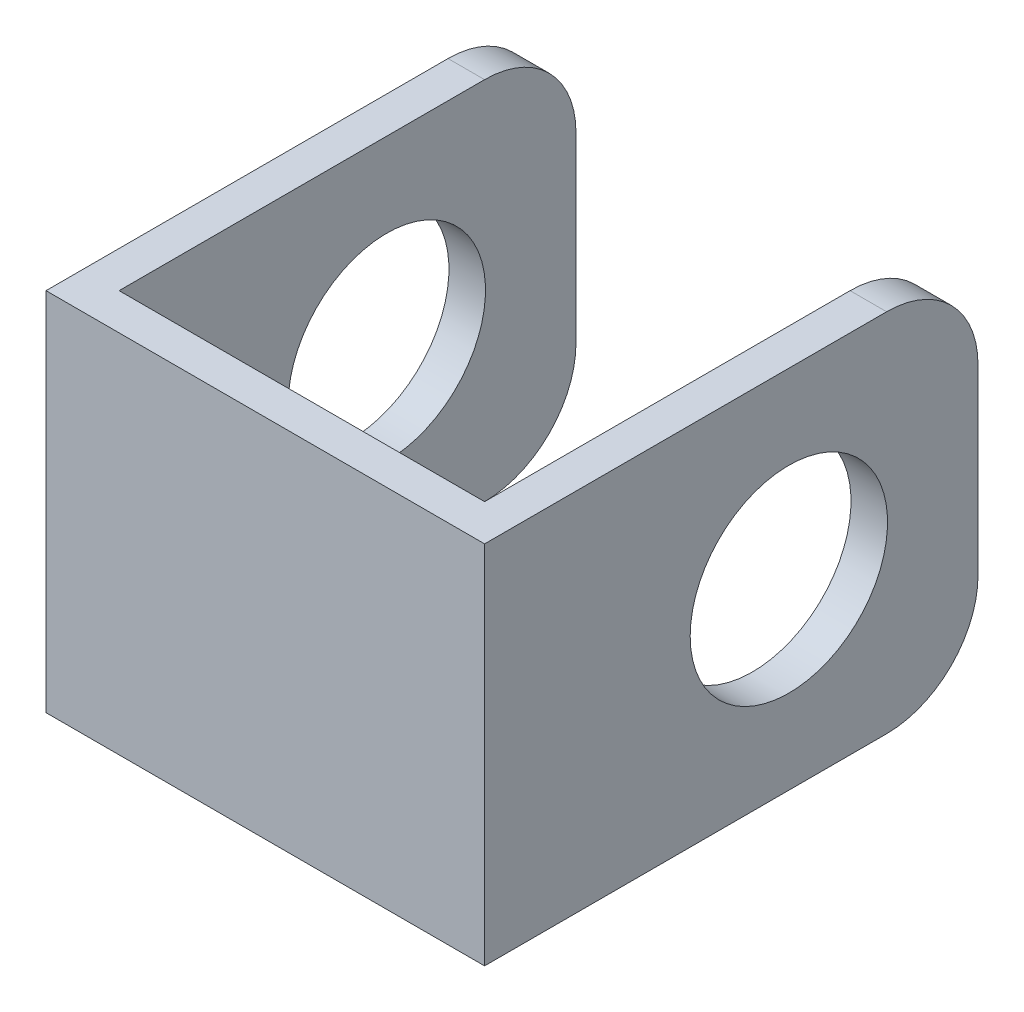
ISO-10303-21;
HEADER;
FILE_DESCRIPTION(('STEP AP214'),'2;1');
FILE_NAME('part.step','',(''),(''),'','','');
FILE_SCHEMA(('AUTOMOTIVE_DESIGN { 1 0 10303 214 1 1 1 1 }'));
ENDSEC;
DATA;
#1=APPLICATION_CONTEXT('core data for automotive mechanical design processes');
#2=APPLICATION_PROTOCOL_DEFINITION('international standard','automotive_design',2000,#1);
#3=PRODUCT_CONTEXT('',#1,'mechanical');
#4=PRODUCT('Part','Part','',(#3));
#5=PRODUCT_RELATED_PRODUCT_CATEGORY('part','',(#4));
#6=PRODUCT_DEFINITION_FORMATION('','',#4);
#7=PRODUCT_DEFINITION_CONTEXT('part definition',#1,'design');
#8=PRODUCT_DEFINITION('design','',#6,#7);
#9=PRODUCT_DEFINITION_SHAPE('','',#8);
#10=(LENGTH_UNIT() NAMED_UNIT(*) SI_UNIT(.MILLI.,.METRE.));
#11=(NAMED_UNIT(*) PLANE_ANGLE_UNIT() SI_UNIT($,.RADIAN.));
#12=(NAMED_UNIT(*) SI_UNIT($,.STERADIAN.) SOLID_ANGLE_UNIT());
#13=UNCERTAINTY_MEASURE_WITH_UNIT(LENGTH_MEASURE(1.E-05),#10,'distance_accuracy_value','');
#14=(GEOMETRIC_REPRESENTATION_CONTEXT(3) GLOBAL_UNCERTAINTY_ASSIGNED_CONTEXT((#13)) GLOBAL_UNIT_ASSIGNED_CONTEXT((#10,
#11,#12)) REPRESENTATION_CONTEXT('',''));
#15=CARTESIAN_POINT('',(0.,0.,0.));
#16=DIRECTION('',(0.,0.,1.));
#17=DIRECTION('',(1.,0.,0.));
#18=AXIS2_PLACEMENT_3D('',#15,#16,#17);
#19=CARTESIAN_POINT('',(12.,0.,-10.35));
#20=DIRECTION('',(0.,0.,-1.));
#21=DIRECTION('',(-1.,0.,0.));
#22=AXIS2_PLACEMENT_3D('',#19,#20,#21);
#23=PLANE('',#22);
#24=DIRECTION('',(0.,1.,0.));
#25=VECTOR('',#24,1.);
#26=CARTESIAN_POINT('',(9.99999999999,0.,-10.35));
#27=LINE('',#26,#25);
#28=CARTESIAN_POINT('',(9.99999999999,5.,-10.35));
#29=VERTEX_POINT('',#28);
#30=CARTESIAN_POINT('',(9.99999999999,-5.,-10.35));
#31=VERTEX_POINT('',#30);
#32=EDGE_CURVE('E102',#29,#31,#27,.F.);
#33=ORIENTED_EDGE('',*,*,#32,.F.);
#34=DIRECTION('',(-1.,0.,0.));
#35=VECTOR('',#34,1.);
#36=CARTESIAN_POINT('',(0.,5.,-10.35));
#37=LINE('',#36,#35);
#38=CARTESIAN_POINT('',(12.,5.,-10.35));
#39=VERTEX_POINT('',#38);
#40=EDGE_CURVE('E113',#39,#29,#37,.T.);
#41=ORIENTED_EDGE('',*,*,#40,.F.);
#42=DIRECTION('',(0.,1.,0.));
#43=VECTOR('',#42,1.);
#44=CARTESIAN_POINT('',(12.,0.,-10.35));
#45=LINE('',#44,#43);
#46=CARTESIAN_POINT('',(12.,-5.,-10.35));
#47=VERTEX_POINT('',#46);
#48=EDGE_CURVE('E117',#39,#47,#45,.F.);
#49=ORIENTED_EDGE('',*,*,#48,.T.);
#50=DIRECTION('',(-1.,0.,0.));
#51=VECTOR('',#50,1.);
#52=CARTESIAN_POINT('',(0.,-5.,-10.35));
#53=LINE('',#52,#51);
#54=EDGE_CURVE('E116',#31,#47,#53,.F.);
#55=ORIENTED_EDGE('',*,*,#54,.F.);
#56=EDGE_LOOP('',(#33,#41,#49,#55));
#57=FACE_BOUND('',#56,.T.);
#58=ADVANCED_FACE('F16',(#57),#23,.T.);
#59=CARTESIAN_POINT('',(0.660000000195,0.,0.));
#60=DIRECTION('',(-1.,0.,0.));
#61=DIRECTION('',(0.,0.,1.));
#62=AXIS2_PLACEMENT_3D('',#59,#60,#61);
#63=CYLINDRICAL_SURFACE('',#62,5.4);
#64=CARTESIAN_POINT('',(12.,0.,0.));
#65=DIRECTION('',(-1.,0.,0.));
#66=DIRECTION('',(0.,0.,1.));
#67=AXIS2_PLACEMENT_3D('',#64,#65,#66);
#68=CIRCLE('',#67,5.4);
#69=CARTESIAN_POINT('',(12.,0.,5.4));
#70=VERTEX_POINT('',#69);
#71=EDGE_CURVE('E147',#70,#70,#68,.F.);
#72=ORIENTED_EDGE('',*,*,#71,.T.);
#73=EDGE_LOOP('',(#72));
#74=FACE_BOUND('',#73,.T.);
#75=CARTESIAN_POINT('',(9.99999999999,0.,0.));
#76=DIRECTION('',(-1.,0.,0.));
#77=DIRECTION('',(0.,0.,1.));
#78=AXIS2_PLACEMENT_3D('',#75,#76,#77);
#79=CIRCLE('',#78,5.4);
#80=CARTESIAN_POINT('',(9.99999999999,0.,5.4));
#81=VERTEX_POINT('',#80);
#82=EDGE_CURVE('E126',#81,#81,#79,.F.);
#83=ORIENTED_EDGE('',*,*,#82,.F.);
#84=EDGE_LOOP('',(#83));
#85=FACE_BOUND('',#84,.T.);
#86=ADVANCED_FACE('F315',(#74,#85),#63,.F.);
#87=CARTESIAN_POINT('',(0.,-5.,-5.35));
#88=DIRECTION('',(-1.,0.,0.));
#89=DIRECTION('',(0.,0.,1.));
#90=AXIS2_PLACEMENT_3D('',#87,#88,#89);
#91=CYLINDRICAL_SURFACE('',#90,5.);
#92=CARTESIAN_POINT('',(12.,-5.,-5.35));
#93=DIRECTION('',(-1.,0.,0.));
#94=DIRECTION('',(0.,0.,1.));
#95=AXIS2_PLACEMENT_3D('',#92,#93,#94);
#96=CIRCLE('',#95,5.);
#97=CARTESIAN_POINT('',(12.,-10.,-5.35));
#98=VERTEX_POINT('',#97);
#99=EDGE_CURVE('E142',#47,#98,#96,.T.);
#100=ORIENTED_EDGE('',*,*,#99,.T.);
#101=DIRECTION('',(1.,0.,0.));
#102=VECTOR('',#101,1.);
#103=CARTESIAN_POINT('',(0.,-10.,-5.35));
#104=LINE('',#103,#102);
#105=CARTESIAN_POINT('',(9.99999999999,-10.,-5.35));
#106=VERTEX_POINT('',#105);
#107=EDGE_CURVE('E125',#98,#106,#104,.F.);
#108=ORIENTED_EDGE('',*,*,#107,.T.);
#109=CARTESIAN_POINT('',(9.99999999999,-5.,-5.35));
#110=DIRECTION('',(-1.,0.,0.));
#111=DIRECTION('',(0.,0.,1.));
#112=AXIS2_PLACEMENT_3D('',#109,#110,#111);
#113=CIRCLE('',#112,5.);
#114=EDGE_CURVE('E19',#31,#106,#113,.T.);
#115=ORIENTED_EDGE('',*,*,#114,.F.);
#116=ORIENTED_EDGE('',*,*,#54,.T.);
#117=EDGE_LOOP('',(#100,#108,#115,#116));
#118=FACE_BOUND('',#117,.T.);
#119=ADVANCED_FACE('F123',(#118),#91,.T.);
#120=CARTESIAN_POINT('',(0.,-5.,-5.35));
#121=DIRECTION('',(-1.,0.,0.));
#122=DIRECTION('',(0.,0.,1.));
#123=AXIS2_PLACEMENT_3D('',#120,#121,#122);
#124=CYLINDRICAL_SURFACE('',#123,5.);
#125=CARTESIAN_POINT('',(-9.99999999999,-5.,-5.35));
#126=DIRECTION('',(-1.,0.,0.));
#127=DIRECTION('',(0.,0.,1.));
#128=AXIS2_PLACEMENT_3D('',#125,#126,#127);
#129=CIRCLE('',#128,5.);
#130=CARTESIAN_POINT('',(-9.99999999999,-10.,-5.35));
#131=VERTEX_POINT('',#130);
#132=CARTESIAN_POINT('',(-9.99999999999,-5.,-10.35));
#133=VERTEX_POINT('',#132);
#134=EDGE_CURVE('E131',#131,#133,#129,.F.);
#135=ORIENTED_EDGE('',*,*,#134,.F.);
#136=DIRECTION('',(1.,0.,0.));
#137=VECTOR('',#136,1.);
#138=CARTESIAN_POINT('',(0.,-10.,-5.35));
#139=LINE('',#138,#137);
#140=CARTESIAN_POINT('',(-12.,-10.,-5.35));
#141=VERTEX_POINT('',#140);
#142=EDGE_CURVE('E181',#131,#141,#139,.F.);
#143=ORIENTED_EDGE('',*,*,#142,.T.);
#144=CARTESIAN_POINT('',(-12.,-5.,-5.35));
#145=DIRECTION('',(-1.,0.,0.));
#146=DIRECTION('',(0.,0.,1.));
#147=AXIS2_PLACEMENT_3D('',#144,#145,#146);
#148=CIRCLE('',#147,5.);
#149=CARTESIAN_POINT('',(-12.,-5.,-10.35));
#150=VERTEX_POINT('',#149);
#151=EDGE_CURVE('E151',#141,#150,#148,.F.);
#152=ORIENTED_EDGE('',*,*,#151,.T.);
#153=DIRECTION('',(-1.,0.,0.));
#154=VECTOR('',#153,1.);
#155=CARTESIAN_POINT('',(12.,-5.,-10.35));
#156=LINE('',#155,#154);
#157=EDGE_CURVE('E120',#133,#150,#156,.T.);
#158=ORIENTED_EDGE('',*,*,#157,.F.);
#159=EDGE_LOOP('',(#135,#143,#152,#158));
#160=FACE_BOUND('',#159,.T.);
#161=ADVANCED_FACE('F249',(#160),#124,.T.);
#162=CARTESIAN_POINT('',(12.,0.,-10.35));
#163=DIRECTION('',(0.,0.,-1.));
#164=DIRECTION('',(-1.,0.,0.));
#165=AXIS2_PLACEMENT_3D('',#162,#163,#164);
#166=PLANE('',#165);
#167=DIRECTION('',(0.,1.,0.));
#168=VECTOR('',#167,1.);
#169=CARTESIAN_POINT('',(-12.,0.,-10.35));
#170=LINE('',#169,#168);
#171=CARTESIAN_POINT('',(-12.,5.,-10.35));
#172=VERTEX_POINT('',#171);
#173=EDGE_CURVE('E154',#150,#172,#170,.T.);
#174=ORIENTED_EDGE('',*,*,#173,.T.);
#175=DIRECTION('',(-1.,0.,0.));
#176=VECTOR('',#175,1.);
#177=CARTESIAN_POINT('',(0.,5.,-10.35));
#178=LINE('',#177,#176);
#179=CARTESIAN_POINT('',(-9.99999999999,5.,-10.35));
#180=VERTEX_POINT('',#179);
#181=EDGE_CURVE('E141',#180,#172,#178,.T.);
#182=ORIENTED_EDGE('',*,*,#181,.F.);
#183=DIRECTION('',(0.,1.,0.));
#184=VECTOR('',#183,1.);
#185=CARTESIAN_POINT('',(-9.99999999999,0.,-10.35));
#186=LINE('',#185,#184);
#187=EDGE_CURVE('E133',#133,#180,#186,.T.);
#188=ORIENTED_EDGE('',*,*,#187,.F.);
#189=ORIENTED_EDGE('',*,*,#157,.T.);
#190=EDGE_LOOP('',(#174,#182,#188,#189));
#191=FACE_BOUND('',#190,.T.);
#192=ADVANCED_FACE('F241',(#191),#166,.T.);
#193=CARTESIAN_POINT('',(0.660000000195,0.,0.));
#194=DIRECTION('',(-1.,0.,0.));
#195=DIRECTION('',(0.,0.,1.));
#196=AXIS2_PLACEMENT_3D('',#193,#194,#195);
#197=CYLINDRICAL_SURFACE('',#196,5.4);
#198=CARTESIAN_POINT('',(-12.,0.,0.));
#199=DIRECTION('',(-1.,0.,0.));
#200=DIRECTION('',(0.,0.,1.));
#201=AXIS2_PLACEMENT_3D('',#198,#199,#200);
#202=CIRCLE('',#201,5.4);
#203=CARTESIAN_POINT('',(-12.,0.,5.4));
#204=VERTEX_POINT('',#203);
#205=EDGE_CURVE('E158',#204,#204,#202,.T.);
#206=ORIENTED_EDGE('',*,*,#205,.T.);
#207=EDGE_LOOP('',(#206));
#208=FACE_BOUND('',#207,.T.);
#209=CARTESIAN_POINT('',(-9.99999999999,0.,0.));
#210=DIRECTION('',(-1.,0.,0.));
#211=DIRECTION('',(0.,0.,1.));
#212=AXIS2_PLACEMENT_3D('',#209,#210,#211);
#213=CIRCLE('',#212,5.4);
#214=CARTESIAN_POINT('',(-9.99999999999,0.,5.4));
#215=VERTEX_POINT('',#214);
#216=EDGE_CURVE('E135',#215,#215,#213,.T.);
#217=ORIENTED_EDGE('',*,*,#216,.F.);
#218=EDGE_LOOP('',(#217));
#219=FACE_BOUND('',#218,.T.);
#220=ADVANCED_FACE('F306',(#208,#219),#197,.F.);
#221=CARTESIAN_POINT('',(0.,5.,-5.35));
#222=DIRECTION('',(-1.,0.,0.));
#223=DIRECTION('',(0.,0.,1.));
#224=AXIS2_PLACEMENT_3D('',#221,#222,#223);
#225=CYLINDRICAL_SURFACE('',#224,5.);
#226=CARTESIAN_POINT('',(12.,5.,-5.35));
#227=DIRECTION('',(-1.,0.,0.));
#228=DIRECTION('',(0.,0.,1.));
#229=AXIS2_PLACEMENT_3D('',#226,#227,#228);
#230=CIRCLE('',#229,5.);
#231=CARTESIAN_POINT('',(12.,10.,-5.35));
#232=VERTEX_POINT('',#231);
#233=EDGE_CURVE('E144',#232,#39,#230,.T.);
#234=ORIENTED_EDGE('',*,*,#233,.T.);
#235=ORIENTED_EDGE('',*,*,#40,.T.);
#236=CARTESIAN_POINT('',(9.99999999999,5.,-5.35));
#237=DIRECTION('',(-1.,0.,0.));
#238=DIRECTION('',(0.,0.,1.));
#239=AXIS2_PLACEMENT_3D('',#236,#237,#238);
#240=CIRCLE('',#239,5.);
#241=CARTESIAN_POINT('',(9.99999999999,10.,-5.35));
#242=VERTEX_POINT('',#241);
#243=EDGE_CURVE('E110',#242,#29,#240,.T.);
#244=ORIENTED_EDGE('',*,*,#243,.F.);
#245=DIRECTION('',(1.,0.,0.));
#246=VECTOR('',#245,1.);
#247=CARTESIAN_POINT('',(0.,10.,-5.35));
#248=LINE('',#247,#246);
#249=EDGE_CURVE('E210',#232,#242,#248,.F.);
#250=ORIENTED_EDGE('',*,*,#249,.F.);
#251=EDGE_LOOP('',(#234,#235,#244,#250));
#252=FACE_BOUND('',#251,.T.);
#253=ADVANCED_FACE('F268',(#252),#225,.T.);
#254=CARTESIAN_POINT('',(9.99999999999,0.,-10.35));
#255=DIRECTION('',(-1.,0.,0.));
#256=DIRECTION('',(0.,0.,1.));
#257=AXIS2_PLACEMENT_3D('',#254,#255,#256);
#258=PLANE('',#257);
#259=ORIENTED_EDGE('',*,*,#82,.T.);
#260=EDGE_LOOP('',(#259));
#261=FACE_BOUND('',#260,.T.);
#262=DIRECTION('',(0.,0.,1.));
#263=VECTOR('',#262,1.);
#264=CARTESIAN_POINT('',(9.99999999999,10.,0.));
#265=LINE('',#264,#263);
#266=CARTESIAN_POINT('',(9.99999999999,10.,14.65));
#267=VERTEX_POINT('',#266);
#268=EDGE_CURVE('E211',#242,#267,#265,.T.);
#269=ORIENTED_EDGE('',*,*,#268,.F.);
#270=ORIENTED_EDGE('',*,*,#243,.T.);
#271=ORIENTED_EDGE('',*,*,#32,.T.);
#272=ORIENTED_EDGE('',*,*,#114,.T.);
#273=DIRECTION('',(0.,0.,1.));
#274=VECTOR('',#273,1.);
#275=CARTESIAN_POINT('',(9.99999999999,-10.,0.));
#276=LINE('',#275,#274);
#277=CARTESIAN_POINT('',(9.99999999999,-10.,14.65));
#278=VERTEX_POINT('',#277);
#279=EDGE_CURVE('E167',#106,#278,#276,.T.);
#280=ORIENTED_EDGE('',*,*,#279,.T.);
#281=DIRECTION('',(0.,1.,0.));
#282=VECTOR('',#281,1.);
#283=CARTESIAN_POINT('',(9.99999999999,0.,14.65));
#284=LINE('',#283,#282);
#285=EDGE_CURVE('E128',#267,#278,#284,.F.);
#286=ORIENTED_EDGE('',*,*,#285,.F.);
#287=EDGE_LOOP('',(#269,#270,#271,#272,#280,#286));
#288=FACE_BOUND('',#287,.T.);
#289=ADVANCED_FACE('F105',(#261,#288),#258,.T.);
#290=CARTESIAN_POINT('',(9.99999999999,0.,14.65));
#291=DIRECTION('',(0.,0.,-1.));
#292=DIRECTION('',(-1.,0.,0.));
#293=AXIS2_PLACEMENT_3D('',#290,#291,#292);
#294=PLANE('',#293);
#295=DIRECTION('',(0.,1.,0.));
#296=VECTOR('',#295,1.);
#297=CARTESIAN_POINT('',(-9.99999999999,0.,14.65));
#298=LINE('',#297,#296);
#299=CARTESIAN_POINT('',(-9.99999999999,10.,14.65));
#300=VERTEX_POINT('',#299);
#301=CARTESIAN_POINT('',(-9.99999999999,-10.,14.65));
#302=VERTEX_POINT('',#301);
#303=EDGE_CURVE('E134',#300,#302,#298,.F.);
#304=ORIENTED_EDGE('',*,*,#303,.F.);
#305=DIRECTION('',(1.,0.,0.));
#306=VECTOR('',#305,1.);
#307=CARTESIAN_POINT('',(0.,10.,14.65));
#308=LINE('',#307,#306);
#309=EDGE_CURVE('E216',#267,#300,#308,.F.);
#310=ORIENTED_EDGE('',*,*,#309,.F.);
#311=ORIENTED_EDGE('',*,*,#285,.T.);
#312=DIRECTION('',(1.,0.,0.));
#313=VECTOR('',#312,1.);
#314=CARTESIAN_POINT('',(0.,-10.,14.65));
#315=LINE('',#314,#313);
#316=EDGE_CURVE('E171',#278,#302,#315,.F.);
#317=ORIENTED_EDGE('',*,*,#316,.T.);
#318=EDGE_LOOP('',(#304,#310,#311,#317));
#319=FACE_BOUND('',#318,.T.);
#320=ADVANCED_FACE('F262',(#319),#294,.T.);
#321=CARTESIAN_POINT('',(-9.99999999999,0.,14.65));
#322=DIRECTION('',(1.,0.,0.));
#323=DIRECTION('',(0.,0.,-1.));
#324=AXIS2_PLACEMENT_3D('',#321,#322,#323);
#325=PLANE('',#324);
#326=ORIENTED_EDGE('',*,*,#216,.T.);
#327=EDGE_LOOP('',(#326));
#328=FACE_BOUND('',#327,.T.);
#329=ORIENTED_EDGE('',*,*,#187,.T.);
#330=CARTESIAN_POINT('',(-9.99999999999,5.,-5.35));
#331=DIRECTION('',(-1.,0.,0.));
#332=DIRECTION('',(0.,0.,1.));
#333=AXIS2_PLACEMENT_3D('',#330,#331,#332);
#334=CIRCLE('',#333,5.);
#335=CARTESIAN_POINT('',(-9.99999999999,10.,-5.35));
#336=VERTEX_POINT('',#335);
#337=EDGE_CURVE('E138',#336,#180,#334,.T.);
#338=ORIENTED_EDGE('',*,*,#337,.F.);
#339=DIRECTION('',(0.,0.,1.));
#340=VECTOR('',#339,1.);
#341=CARTESIAN_POINT('',(-9.99999999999,10.,0.));
#342=LINE('',#341,#340);
#343=EDGE_CURVE('E223',#300,#336,#342,.F.);
#344=ORIENTED_EDGE('',*,*,#343,.F.);
#345=ORIENTED_EDGE('',*,*,#303,.T.);
#346=DIRECTION('',(0.,0.,1.));
#347=VECTOR('',#346,1.);
#348=CARTESIAN_POINT('',(-9.99999999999,-10.,0.));
#349=LINE('',#348,#347);
#350=EDGE_CURVE('E176',#302,#131,#349,.F.);
#351=ORIENTED_EDGE('',*,*,#350,.T.);
#352=ORIENTED_EDGE('',*,*,#134,.T.);
#353=EDGE_LOOP('',(#329,#338,#344,#345,#351,#352));
#354=FACE_BOUND('',#353,.T.);
#355=ADVANCED_FACE('F256',(#328,#354),#325,.T.);
#356=CARTESIAN_POINT('',(0.,5.,-5.35));
#357=DIRECTION('',(-1.,0.,0.));
#358=DIRECTION('',(0.,0.,1.));
#359=AXIS2_PLACEMENT_3D('',#356,#357,#358);
#360=CYLINDRICAL_SURFACE('',#359,5.);
#361=ORIENTED_EDGE('',*,*,#337,.T.);
#362=ORIENTED_EDGE('',*,*,#181,.T.);
#363=CARTESIAN_POINT('',(-12.,5.,-5.35));
#364=DIRECTION('',(-1.,0.,0.));
#365=DIRECTION('',(0.,0.,1.));
#366=AXIS2_PLACEMENT_3D('',#363,#364,#365);
#367=CIRCLE('',#366,5.);
#368=CARTESIAN_POINT('',(-12.,10.,-5.35));
#369=VERTEX_POINT('',#368);
#370=EDGE_CURVE('E156',#172,#369,#367,.F.);
#371=ORIENTED_EDGE('',*,*,#370,.T.);
#372=DIRECTION('',(1.,0.,0.));
#373=VECTOR('',#372,1.);
#374=CARTESIAN_POINT('',(0.,10.,-5.35));
#375=LINE('',#374,#373);
#376=EDGE_CURVE('E205',#336,#369,#375,.F.);
#377=ORIENTED_EDGE('',*,*,#376,.F.);
#378=EDGE_LOOP('',(#361,#362,#371,#377));
#379=FACE_BOUND('',#378,.T.);
#380=ADVANCED_FACE('F291',(#379),#360,.T.);
#381=CARTESIAN_POINT('',(12.,0.,-10.35));
#382=DIRECTION('',(-1.,0.,0.));
#383=DIRECTION('',(0.,0.,1.));
#384=AXIS2_PLACEMENT_3D('',#381,#382,#383);
#385=PLANE('',#384);
#386=ORIENTED_EDGE('',*,*,#71,.F.);
#387=EDGE_LOOP('',(#386));
#388=FACE_BOUND('',#387,.T.);
#389=DIRECTION('',(0.,0.,1.));
#390=VECTOR('',#389,1.);
#391=CARTESIAN_POINT('',(12.,10.,0.));
#392=LINE('',#391,#390);
#393=CARTESIAN_POINT('',(12.,10.,16.65));
#394=VERTEX_POINT('',#393);
#395=EDGE_CURVE('E198',#394,#232,#392,.F.);
#396=ORIENTED_EDGE('',*,*,#395,.F.);
#397=DIRECTION('',(0.,1.,0.));
#398=VECTOR('',#397,1.);
#399=CARTESIAN_POINT('',(12.,0.,16.65));
#400=LINE('',#399,#398);
#401=CARTESIAN_POINT('',(12.,-10.,16.65));
#402=VERTEX_POINT('',#401);
#403=EDGE_CURVE('E187',#394,#402,#400,.F.);
#404=ORIENTED_EDGE('',*,*,#403,.T.);
#405=DIRECTION('',(0.,0.,1.));
#406=VECTOR('',#405,1.);
#407=CARTESIAN_POINT('',(12.,-10.,0.));
#408=LINE('',#407,#406);
#409=EDGE_CURVE('E150',#402,#98,#408,.F.);
#410=ORIENTED_EDGE('',*,*,#409,.T.);
#411=ORIENTED_EDGE('',*,*,#99,.F.);
#412=ORIENTED_EDGE('',*,*,#48,.F.);
#413=ORIENTED_EDGE('',*,*,#233,.F.);
#414=EDGE_LOOP('',(#396,#404,#410,#411,#412,#413));
#415=FACE_BOUND('',#414,.T.);
#416=ADVANCED_FACE('F270',(#388,#415),#385,.F.);
#417=CARTESIAN_POINT('',(0.,-10.,0.));
#418=DIRECTION('',(0.,1.,0.));
#419=DIRECTION('',(0.,0.,1.));
#420=AXIS2_PLACEMENT_3D('',#417,#418,#419);
#421=PLANE('',#420);
#422=ORIENTED_EDGE('',*,*,#350,.F.);
#423=ORIENTED_EDGE('',*,*,#316,.F.);
#424=ORIENTED_EDGE('',*,*,#279,.F.);
#425=ORIENTED_EDGE('',*,*,#107,.F.);
#426=ORIENTED_EDGE('',*,*,#409,.F.);
#427=DIRECTION('',(-1.,0.,0.));
#428=VECTOR('',#427,1.);
#429=CARTESIAN_POINT('',(11.9999999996,-10.,16.65));
#430=LINE('',#429,#428);
#431=CARTESIAN_POINT('',(-12.,-10.,16.65));
#432=VERTEX_POINT('',#431);
#433=EDGE_CURVE('E184',#402,#432,#430,.T.);
#434=ORIENTED_EDGE('',*,*,#433,.T.);
#435=DIRECTION('',(0.,0.,-1.));
#436=VECTOR('',#435,1.);
#437=CARTESIAN_POINT('',(-12.,-10.,16.6499999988));
#438=LINE('',#437,#436);
#439=EDGE_CURVE('E155',#432,#141,#438,.T.);
#440=ORIENTED_EDGE('',*,*,#439,.T.);
#441=ORIENTED_EDGE('',*,*,#142,.F.);
#442=EDGE_LOOP('',(#422,#423,#424,#425,#426,#434,#440,#441));
#443=FACE_BOUND('',#442,.T.);
#444=ADVANCED_FACE('F253',(#443),#421,.F.);
#445=CARTESIAN_POINT('',(-12.,0.,16.6499999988));
#446=DIRECTION('',(1.,0.,0.));
#447=DIRECTION('',(0.,0.,-1.));
#448=AXIS2_PLACEMENT_3D('',#445,#446,#447);
#449=PLANE('',#448);
#450=ORIENTED_EDGE('',*,*,#205,.F.);
#451=EDGE_LOOP('',(#450));
#452=FACE_BOUND('',#451,.T.);
#453=ORIENTED_EDGE('',*,*,#173,.F.);
#454=ORIENTED_EDGE('',*,*,#151,.F.);
#455=ORIENTED_EDGE('',*,*,#439,.F.);
#456=DIRECTION('',(0.,1.,0.));
#457=VECTOR('',#456,1.);
#458=CARTESIAN_POINT('',(-12.,0.,16.65));
#459=LINE('',#458,#457);
#460=CARTESIAN_POINT('',(-12.,10.,16.65));
#461=VERTEX_POINT('',#460);
#462=EDGE_CURVE('E25',#432,#461,#459,.T.);
#463=ORIENTED_EDGE('',*,*,#462,.T.);
#464=DIRECTION('',(0.,0.,1.));
#465=VECTOR('',#464,1.);
#466=CARTESIAN_POINT('',(-12.,10.,0.));
#467=LINE('',#466,#465);
#468=EDGE_CURVE('E33',#369,#461,#467,.T.);
#469=ORIENTED_EDGE('',*,*,#468,.F.);
#470=ORIENTED_EDGE('',*,*,#370,.F.);
#471=EDGE_LOOP('',(#453,#454,#455,#463,#469,#470));
#472=FACE_BOUND('',#471,.T.);
#473=ADVANCED_FACE('F247',(#452,#472),#449,.F.);
#474=CARTESIAN_POINT('',(0.,10.,0.));
#475=DIRECTION('',(0.,1.,0.));
#476=DIRECTION('',(0.,0.,1.));
#477=AXIS2_PLACEMENT_3D('',#474,#475,#476);
#478=PLANE('',#477);
#479=ORIENTED_EDGE('',*,*,#343,.T.);
#480=ORIENTED_EDGE('',*,*,#376,.T.);
#481=ORIENTED_EDGE('',*,*,#468,.T.);
#482=DIRECTION('',(-1.,0.,0.));
#483=VECTOR('',#482,1.);
#484=CARTESIAN_POINT('',(11.9999999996,10.,16.65));
#485=LINE('',#484,#483);
#486=EDGE_CURVE('E11',#461,#394,#485,.F.);
#487=ORIENTED_EDGE('',*,*,#486,.T.);
#488=ORIENTED_EDGE('',*,*,#395,.T.);
#489=ORIENTED_EDGE('',*,*,#249,.T.);
#490=ORIENTED_EDGE('',*,*,#268,.T.);
#491=ORIENTED_EDGE('',*,*,#309,.T.);
#492=EDGE_LOOP('',(#479,#480,#481,#487,#488,#489,#490,#491));
#493=FACE_BOUND('',#492,.T.);
#494=ADVANCED_FACE('F264',(#493),#478,.T.);
#495=CARTESIAN_POINT('',(11.9999999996,0.,16.65));
#496=DIRECTION('',(0.,0.,-1.));
#497=DIRECTION('',(-1.,0.,0.));
#498=AXIS2_PLACEMENT_3D('',#495,#496,#497);
#499=PLANE('',#498);
#500=ORIENTED_EDGE('',*,*,#462,.F.);
#501=ORIENTED_EDGE('',*,*,#433,.F.);
#502=ORIENTED_EDGE('',*,*,#403,.F.);
#503=ORIENTED_EDGE('',*,*,#486,.F.);
#504=EDGE_LOOP('',(#500,#501,#502,#503));
#505=FACE_BOUND('',#504,.T.);
#506=ADVANCED_FACE('F275',(#505),#499,.F.);
#507=CLOSED_SHELL('',(#58,#86,#119,#161,#192,#220,#253,#289,#320,#355,#380,#416,#444,#473,#494,#506));
#508=MANIFOLD_SOLID_BREP('B1',#507);
#509=ADVANCED_BREP_SHAPE_REPRESENTATION('',(#18,#508),#14);
#510=SHAPE_DEFINITION_REPRESENTATION(#9,#509);
ENDSEC;
END-ISO-10303-21;
